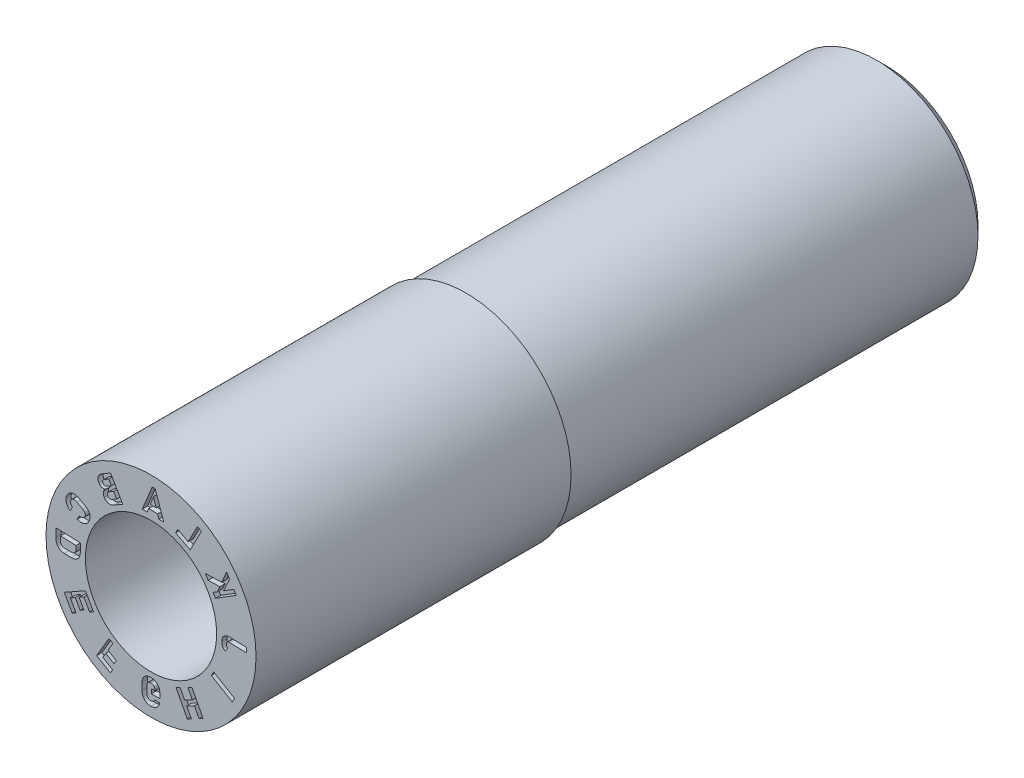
from build123d import *

# Parameters (mm, degrees)
SKETCH5_W          = 8
SKETCH5_H          = 1
CUT_EXTRUDE1_DEPTH = 0.1
CUT_EXTRUDE2_DEPTH = 1.4


with BuildPart() as part:
    # Sketch1 → Revolve1 (revolve)
    with BuildSketch(Plane(origin=(0, 0, 0), x_dir=(0, 0, -1), z_dir=(1, 0, 0)), mode=Mode.PRIVATE) as revolve1_sk:
        Polygon((0, 2), (0, 1.25), (2.3, 1.25), (2.3, 0.7), (11, 0.7), (11, 1), (14, 1), (14, 1.75), (13.75, 2), align=None)
    revolve(revolve1_sk.sketch.rotate(Axis((0, 0, 3.797909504), (0, 0, -1)), 90), axis=Axis((0, 0, 3.797909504), (0, 0, -1)))

    # Sketch5 → Cut-Revolve1 (revolve, cut)
    with BuildSketch(Plane(origin=(0, 0, 0), x_dir=(0, 0, -1), z_dir=(1, 0, 0)), mode=Mode.PRIVATE) as cut_revolve1_sk:
        with Locations((10, 2.435)):
            Rectangle(SKETCH5_W, SKETCH5_H)
    revolve(cut_revolve1_sk.sketch.rotate(Axis((0, 0, 0), (0, 0, -1)), 90), axis=Axis((0, 0, 0), (0, 0, -1)), mode=Mode.SUBTRACT)

    # Sketch2 → Cut-Extrude1 (cut)
    # profile 1 of 12: a face of its own
    with BuildSketch(Plane.XY):
        Polygon((1.381212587, 0.776958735), (1.496621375, 1.02720109), (1.438429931, 1.120801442), (1.348322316, 0.902255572), (1.03337183, 0.891912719), (1.088285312, 0.803622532), (1.310974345, 0.811672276), (1.267502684, 0.70623666), (1.181978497, 0.65304474), (1.228250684, 0.578619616), (1.622964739, 0.824112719), (1.576692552, 0.898537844), align=None)
    # profile 2 of 12: a face of its own
    with BuildSketch(Plane.XY):
        Polygon((0.960546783, 1.548117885), (0.882788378, 1.588596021), (0.706967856, 1.25096761), (0.508350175, 1.35436682), (0.469332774, 1.279470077), (0.74570217, 1.135551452), align=None)
    # profile 3 of 12: a face of its own
    with BuildSketch(Plane.XY):
        Polygon((0.079383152, 1.810573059), (0.023916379, 1.812203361), (-0.166871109, 1.353559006), (-0.072752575, 1.350873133), (-0.044591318, 1.424386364), (0.125311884, 1.41949923), (0.14921421, 1.344440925), (0.243238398, 1.341760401), align=None)
        Polygon((0.047336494, 1.664358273), (0.098229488, 1.504543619), (-0.012662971, 1.507733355), align=None, mode=Mode.SUBTRACT)
    # profile 4 of 12: a face of its own
    with BuildSketch(Plane.XY):
        Polygon((-1.369071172, -0.703640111), (-1.278697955, -0.652777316), (-1.169444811, -0.846851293), (-1.096124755, -0.805632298), (-1.248214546, -0.535511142), (-1.651541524, -0.762506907), (-1.499451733, -1.032628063), (-1.426261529, -0.99144066), (-1.535536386, -0.797328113), (-1.442331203, -0.744871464), (-1.350230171, -0.908506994), (-1.276990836, -0.867238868), align=None)
    # profile 5 of 12: a face of its own
    with BuildSketch(Plane.XY):
        Polygon((-0.818029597, -1.301353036), (-0.724539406, -1.142713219), (-0.799850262, -1.098358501), (-1.035402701, -1.498058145), (-0.772937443, -1.652731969), (-0.730123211, -1.580105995), (-0.917302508, -1.469805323), (-0.860767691, -1.373873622), (-0.703740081, -1.466359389), (-0.66096293, -1.393861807), align=None)
    # profile 6 of 12: a face of its own
    with BuildSketch(Plane.XY):
        with BuildLine():
            Line((-0.76999513, 1.645690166), (-0.932770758, 1.551211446))
            add(Edge.make_bspline(
                [(-0.932770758, 1.551211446), (-0.944851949, 1.544305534), (-0.96148658, 1.532651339), (-0.980382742, 1.514469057), (-0.991605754, 1.500427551), (-1.000489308, 1.485769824), (-1.006965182, 1.470551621), (-1.010795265, 1.454778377), (-1.012072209, 1.438596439), (-1.011042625, 1.422065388), (-1.005764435, 1.399168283), (-0.998456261, 1.382638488), (-0.992217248, 1.372063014)],
                knots=[0, 0, 0, 0, 0.19484118, 0.28294724, 0.366427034, 0.445852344, 0.52229235, 0.597128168, 0.672122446, 0.748836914, 0.828156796, 1, 1, 1, 1], degree=3))
            add(Edge.make_bspline(
                [(-0.992217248, 1.372063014), (-0.987840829, 1.364759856), (-0.980697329, 1.354303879), (-0.968655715, 1.34301533), (-0.959247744, 1.335893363), (-0.948994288, 1.330341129), (-0.938260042, 1.325964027), (-0.92684056, 1.323246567), (-0.914935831, 1.321933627), (-0.902588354, 1.321954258), (-0.885177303, 1.324089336), (-0.872225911, 1.327783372), (-0.863639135, 1.330975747)],
                knots=[0, 0, 0, 0, 0.17252886, 0.253082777, 0.332553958, 0.410187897, 0.487931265, 0.566064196, 0.646434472, 0.729377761, 0.814892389, 1, 1, 1, 1], degree=3))
            add(Edge.make_bspline(
                [(-0.863639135, 1.330975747), (-0.871279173, 1.324980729), (-0.881809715, 1.315279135), (-0.893113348, 1.300393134), (-0.899630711, 1.288880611), (-0.904784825, 1.277020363), (-0.908006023, 1.264757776), (-0.909711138, 1.252244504), (-0.909500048, 1.239480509), (-0.907719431, 1.226525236), (-0.902916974, 1.208715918), (-0.896854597, 1.195921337), (-0.89204892, 1.187636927)],
                knots=[0, 0, 0, 0, 0.180279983, 0.263920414, 0.345728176, 0.425166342, 0.503120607, 0.580165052, 0.658736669, 0.739148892, 0.82220143, 1, 1, 1, 1], degree=3))
            Line((-0.89204892, 1.187636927), (-0.891592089, 1.186722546))
            add(Edge.make_bspline(
                [(-0.891592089, 1.186722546), (-0.885361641, 1.1760686), (-0.874770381, 1.161196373), (-0.857155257, 1.145374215), (-0.843285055, 1.136099), (-0.828498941, 1.129101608), (-0.81277676, 1.124724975), (-0.796287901, 1.122628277), (-0.779050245, 1.123177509), (-0.76125995, 1.126034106), (-0.736064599, 1.133386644), (-0.717785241, 1.142269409), (-0.705755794, 1.149250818)],
                knots=[0, 0, 0, 0, 0.17235677, 0.251845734, 0.328866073, 0.40420085, 0.478853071, 0.555422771, 0.635018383, 0.718404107, 0.805968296, 1, 1, 1, 1], degree=3))
            Line((-0.705755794, 1.149250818), (-0.674117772, 1.167606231))
            Line((-0.674117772, 1.167606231), (-0.538255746, 1.246470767))
            Line((-0.538255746, 1.246470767), (-0.76999513, 1.645690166))
        make_face()
        with BuildLine():
            Line((-0.71124775, 1.371339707), (-0.655493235, 1.275290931))
            Line((-0.655493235, 1.275290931), (-0.740625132, 1.22590533))
            add(Edge.make_bspline(
                [(-0.740625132, 1.22590533), (-0.748329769, 1.221497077), (-0.760153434, 1.216076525), (-0.776587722, 1.213838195), (-0.787754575, 1.214804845), (-0.798213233, 1.218036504), (-0.811134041, 1.225988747), (-0.818474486, 1.235139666), (-0.822350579, 1.241941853)],
                knots=[0, 0, 0, 0, 0.283177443, 0.406051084, 0.522898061, 0.63653052, 0.750637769, 1, 1, 1, 1], degree=3))
            Line((-0.822350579, 1.241941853), (-0.82280741, 1.242856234))
            add(Edge.make_bspline(
                [(-0.82280741, 1.242856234), (-0.825469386, 1.247576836), (-0.828985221, 1.254801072), (-0.83117338, 1.264958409), (-0.83164284, 1.272238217), (-0.830945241, 1.279351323), (-0.82937095, 1.286337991), (-0.826300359, 1.292990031), (-0.822398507, 1.299498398), (-0.817383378, 1.305696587), (-0.809128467, 1.313814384), (-0.801634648, 1.318752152), (-0.796422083, 1.321929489)],
                knots=[0, 0, 0, 0, 0.172443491, 0.251642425, 0.328086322, 0.402714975, 0.477610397, 0.553923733, 0.633837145, 0.717731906, 0.805932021, 1, 1, 1, 1], degree=3))
            Line((-0.796422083, 1.321929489), (-0.71124775, 1.371339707))
        make_face(mode=Mode.SUBTRACT)
        with BuildLine():
            Line((-0.753380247, 1.443921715), (-0.8385011, 1.39454252))
            add(Edge.make_bspline(
                [(-0.8385011, 1.39454252), (-0.845445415, 1.390461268), (-0.856258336, 1.385719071), (-0.871216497, 1.383886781), (-0.881448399, 1.384935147), (-0.890980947, 1.388331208), (-0.903122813, 1.395782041), (-0.909647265, 1.404845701), (-0.913510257, 1.41109266)],
                knots=[0, 0, 0, 0, 0.277909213, 0.39883638, 0.514792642, 0.628277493, 0.744294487, 1, 1, 1, 1], degree=3))
            add(Edge.make_bspline(
                [(-0.913510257, 1.41109266), (-0.916820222, 1.416906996), (-0.920714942, 1.426324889), (-0.920561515, 1.43940649), (-0.918390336, 1.448683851), (-0.913872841, 1.457505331), (-0.90480302, 1.469312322), (-0.895010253, 1.475901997), (-0.888194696, 1.480109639)],
                knots=[0, 0, 0, 0, 0.243538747, 0.354355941, 0.466789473, 0.583916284, 0.708822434, 1, 1, 1, 1], degree=3))
            Line((-0.888194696, 1.480109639), (-0.803056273, 1.529499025))
            Line((-0.803056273, 1.529499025), (-0.753380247, 1.443921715))
        make_face(mode=Mode.SUBTRACT)
    # profile 7 of 12: a face of its own
    with BuildSketch(Plane.XY):
        Polygon((0.826795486, -1.394382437), (0.915050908, -1.563830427), (0.992334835, -1.523602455), (0.778913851, -1.113840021), (0.701629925, -1.154067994), (0.788091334, -1.320071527), (0.640968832, -1.396700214), (0.55450727, -1.230696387), (0.477354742, -1.270899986), (0.690775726, -1.68066242), (0.767928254, -1.64045882), (0.679672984, -1.471011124), align=None)
    # profile 8 of 12: a face of its own
    with BuildSketch(Plane.XY):
        with BuildLine():
            Line((-1.257346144, 0.865272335), (-1.369236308, 0.926025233))
            add(Edge.make_bspline(
                [(-1.369236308, 0.926025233), (-1.376996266, 0.93025275), (-1.388711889, 0.935946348), (-1.404572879, 0.942279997), (-1.416163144, 0.945971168), (-1.42754116, 0.949160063), (-1.438841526, 0.951426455), (-1.449996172, 0.952818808), (-1.460965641, 0.953536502), (-1.471744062, 0.953437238), (-1.482287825, 0.952526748), (-1.492614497, 0.950956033), (-1.502719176, 0.948619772), (-1.512517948, 0.945305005), (-1.522184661, 0.941516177), (-1.531502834, 0.936752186), (-1.540605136, 0.931292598), (-1.549452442, 0.925131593), (-1.557906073, 0.918106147), (-1.566125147, 0.910448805), (-1.573911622, 0.901953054), (-1.581401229, 0.892804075), (-1.591101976, 0.879433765), (-1.59765434, 0.86867861), (-1.601701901, 0.861172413)],
                knots=[0, 0, 0, 0, 0.096578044, 0.142249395, 0.186560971, 0.229482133, 0.271363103, 0.312409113, 0.352282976, 0.391447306, 0.430113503, 0.467872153, 0.50555694, 0.543307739, 0.58085384, 0.61895477, 0.657544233, 0.696821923, 0.736671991, 0.777602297, 0.819525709, 0.86253931, 0.906790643, 1, 1, 1, 1], degree=3))
            add(Edge.make_bspline(
                [(-1.601701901, 0.861172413), (-1.608322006, 0.848980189), (-1.616397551, 0.829904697), (-1.621537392, 0.803281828), (-1.622874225, 0.783603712), (-1.62155904, 0.763997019), (-1.617606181, 0.744621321), (-1.611003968, 0.725572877), (-1.60176879, 0.706933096), (-1.590019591, 0.688758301), (-1.57062437, 0.664663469), (-1.552950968, 0.648690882), (-1.5402667, 0.63865604)],
                knots=[0, 0, 0, 0, 0.164326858, 0.242585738, 0.319786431, 0.397014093, 0.474298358, 0.553007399, 0.63480756, 0.719758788, 0.808514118, 1, 1, 1, 1], degree=3))
            Line((-1.5402667, 0.63865604), (-1.497020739, 0.718336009))
            add(Edge.make_bspline(
                [(-1.497020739, 0.718336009), (-1.502657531, 0.723144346), (-1.510253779, 0.730926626), (-1.518920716, 0.74214654), (-1.523982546, 0.750685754), (-1.527980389, 0.7593218), (-1.531096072, 0.767939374), (-1.53285784, 0.776715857), (-1.53358919, 0.785464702), (-1.533323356, 0.794192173), (-1.53101056, 0.805813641), (-1.527864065, 0.814221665), (-1.524833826, 0.819480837)],
                knots=[0, 0, 0, 0, 0.194580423, 0.285088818, 0.372104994, 0.454905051, 0.535045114, 0.612398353, 0.689462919, 0.765515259, 0.841074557, 1, 1, 1, 1], degree=3))
            add(Edge.make_bspline(
                [(-1.524833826, 0.819480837), (-1.521202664, 0.826200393), (-1.514925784, 0.835513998), (-1.50458527, 0.845782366), (-1.496278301, 0.85171523), (-1.487409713, 0.856305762), (-1.477887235, 0.859190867), (-1.467903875, 0.860823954), (-1.457434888, 0.860866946), (-1.446554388, 0.859545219), (-1.431210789, 0.85533581), (-1.419869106, 0.850589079), (-1.412533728, 0.846424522)],
                knots=[0, 0, 0, 0, 0.174575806, 0.25460613, 0.33169913, 0.406966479, 0.48170551, 0.558069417, 0.637335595, 0.720086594, 0.807714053, 1, 1, 1, 1], degree=3))
            Line((-1.412533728, 0.846424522), (-1.300643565, 0.785671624))
            add(Edge.make_bspline(
                [(-1.300643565, 0.785671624), (-1.293202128, 0.781671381), (-1.282911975, 0.774900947), (-1.271138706, 0.764206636), (-1.264113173, 0.755881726), (-1.258601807, 0.747056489), (-1.25453323, 0.73787993), (-1.251994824, 0.728321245), (-1.250936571, 0.718447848), (-1.251363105, 0.708246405), (-1.254335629, 0.693956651), (-1.258634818, 0.683548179), (-1.262308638, 0.676824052)],
                knots=[0, 0, 0, 0, 0.193323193, 0.280391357, 0.363185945, 0.441772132, 0.517735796, 0.592050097, 0.66716421, 0.744174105, 0.824716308, 1, 1, 1, 1], degree=3))
            add(Edge.make_bspline(
                [(-1.262308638, 0.676824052), (-1.265236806, 0.671466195), (-1.270379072, 0.66391153), (-1.279099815, 0.655717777), (-1.286066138, 0.650416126), (-1.293823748, 0.646284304), (-1.302060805, 0.64289083), (-1.310950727, 0.640711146), (-1.320354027, 0.63949303), (-1.330266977, 0.639291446), (-1.34449062, 0.640449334), (-1.355188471, 0.643042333), (-1.362346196, 0.64522315)],
                knots=[0, 0, 0, 0, 0.160106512, 0.236416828, 0.312414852, 0.38847097, 0.465745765, 0.544991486, 0.627212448, 0.713454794, 0.803971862, 1, 1, 1, 1], degree=3))
            Line((-1.362346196, 0.64522315), (-1.405592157, 0.565543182))
            add(Edge.make_bspline(
                [(-1.405592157, 0.565543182), (-1.390234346, 0.560344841), (-1.367129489, 0.554483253), (-1.336331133, 0.551318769), (-1.314683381, 0.551424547), (-1.29403936, 0.553808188), (-1.274480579, 0.558604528), (-1.256105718, 0.565773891), (-1.238916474, 0.575191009), (-1.223161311, 0.586971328), (-1.20362285, 0.60572215), (-1.192129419, 0.622949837), (-1.185389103, 0.635053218)],
                knots=[0, 0, 0, 0, 0.191936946, 0.280786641, 0.365795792, 0.447660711, 0.526184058, 0.603468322, 0.680471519, 0.757424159, 0.835658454, 1, 1, 1, 1], degree=3))
            add(Edge.make_bspline(
                [(-1.185389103, 0.635053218), (-1.181418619, 0.642591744), (-1.175787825, 0.653879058), (-1.16996221, 0.669351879), (-1.166270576, 0.680600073), (-1.163515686, 0.691769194), (-1.161464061, 0.702794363), (-1.160351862, 0.713711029), (-1.159867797, 0.724482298), (-1.160208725, 0.735107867), (-1.161357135, 0.745524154), (-1.163179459, 0.755722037), (-1.165951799, 0.765641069), (-1.169274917, 0.775423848), (-1.173628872, 0.78490638), (-1.178501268, 0.794303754), (-1.184348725, 0.803352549), (-1.190826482, 0.8122204), (-1.198222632, 0.820638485), (-1.206121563, 0.828992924), (-1.215023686, 0.836774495), (-1.224482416, 0.844476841), (-1.238431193, 0.854330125), (-1.24960673, 0.861038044), (-1.257346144, 0.865272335)],
                knots=[0, 0, 0, 0, 0.093262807, 0.137640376, 0.180739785, 0.22266658, 0.263368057, 0.303292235, 0.342581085, 0.381222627, 0.41943327, 0.457118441, 0.494380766, 0.531982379, 0.569989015, 0.608385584, 0.647662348, 0.687699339, 0.728383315, 0.770139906, 0.813349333, 0.857582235, 0.903517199, 1, 1, 1, 1], degree=3))
        make_face()
    # profile 9 of 12: a face of its own
    with BuildSketch(Plane.XY):
        with BuildLine():
            Line((-1.805473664, 0.221110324), (-1.810357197, 0.067733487))
            add(Edge.make_bspline(
                [(-1.810357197, 0.067733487), (-1.810768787, 0.058379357), (-1.810426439, 0.044597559), (-1.8091359, 0.026582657), (-1.807367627, 0.013866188), (-1.805075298, 0.00161944), (-1.802030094, -0.010065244), (-1.798507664, -0.021298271), (-1.794305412, -0.03195861), (-1.789415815, -0.042040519), (-1.784126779, -0.051650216), (-1.778041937, -0.060540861), (-1.771444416, -0.068860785), (-1.764382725, -0.076665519), (-1.756666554, -0.083809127), (-1.748356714, -0.090347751), (-1.739413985, -0.09619119), (-1.730037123, -0.101593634), (-1.72004955, -0.106193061), (-1.709586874, -0.110199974), (-1.698632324, -0.113548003), (-1.68720422, -0.116280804), (-1.671044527, -0.11915859), (-1.658544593, -0.120052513), (-1.65007769, -0.120367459)],
                knots=[0, 0, 0, 0, 0.099840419, 0.147050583, 0.19267447, 0.236787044, 0.279949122, 0.321464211, 0.362367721, 0.402106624, 0.44099024, 0.479320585, 0.516927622, 0.554255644, 0.591533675, 0.629018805, 0.66696391, 0.705454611, 0.744410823, 0.784179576, 0.824950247, 0.866567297, 0.909520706, 1, 1, 1, 1], degree=3))
            Line((-1.65007769, -0.120367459), (-1.518627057, -0.124579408))
            add(Edge.make_bspline(
                [(-1.518627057, -0.124579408), (-1.510537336, -0.124763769), (-1.498548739, -0.124653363), (-1.482875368, -0.122966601), (-1.471670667, -0.121074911), (-1.460861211, -0.118416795), (-1.450379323, -0.115246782), (-1.440302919, -0.111340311), (-1.430576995, -0.106879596), (-1.421352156, -0.101659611), (-1.412504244, -0.095951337), (-1.4042809, -0.089384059), (-1.39650409, -0.082199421), (-1.389175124, -0.074383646), (-1.382444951, -0.065819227), (-1.376168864, -0.056683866), (-1.37040295, -0.046872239), (-1.365174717, -0.03647564), (-1.360679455, -0.025379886), (-1.356712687, -0.013754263), (-1.353329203, -0.001523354), (-1.350728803, 0.011315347), (-1.348043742, 0.029580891), (-1.346816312, 0.043642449), (-1.346618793, 0.053226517)],
                knots=[0, 0, 0, 0, 0.086517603, 0.127857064, 0.168353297, 0.207852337, 0.246738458, 0.285295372, 0.3232555, 0.360976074, 0.398475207, 0.43565571, 0.473275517, 0.511549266, 0.550019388, 0.5895643, 0.629909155, 0.671546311, 0.71380609, 0.757736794, 0.802760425, 0.849318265, 0.897623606, 1, 1, 1, 1], degree=3))
            Line((-1.346618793, 0.053226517), (-1.341753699, 0.206320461))
            Line((-1.341753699, 0.206320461), (-1.805473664, 0.221110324))
        make_face()
        with BuildLine():
            Line((-1.428757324, 0.121591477), (-1.430875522, 0.053604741))
            add(Edge.make_bspline(
                [(-1.430875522, 0.053604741), (-1.431130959, 0.046837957), (-1.431958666, 0.036931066), (-1.434681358, 0.024323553), (-1.436977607, 0.015659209), (-1.440384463, 0.007768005), (-1.444118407, 0.000392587), (-1.448541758, -0.006350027), (-1.453593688, -0.012423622), (-1.459275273, -0.017710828), (-1.465404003, -0.022421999), (-1.472074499, -0.026333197), (-1.47932567, -0.029404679), (-1.487046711, -0.031698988), (-1.498295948, -0.034006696), (-1.507121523, -0.034304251), (-1.513109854, -0.034123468)],
                knots=[0, 0, 0, 0, 0.148913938, 0.217405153, 0.283219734, 0.345356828, 0.405771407, 0.46464101, 0.522070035, 0.578853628, 0.634762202, 0.691562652, 0.748185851, 0.807298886, 0.868222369, 1, 1, 1, 1], degree=3))
            Line((-1.513109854, -0.034123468), (-1.649664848, -0.029768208))
            add(Edge.make_bspline(
                [(-1.649664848, -0.029768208), (-1.655640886, -0.02946593), (-1.664451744, -0.028725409), (-1.6755542, -0.025788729), (-1.683136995, -0.022897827), (-1.690153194, -0.019349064), (-1.696648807, -0.015096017), (-1.702475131, -0.010017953), (-1.707798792, -0.004307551), (-1.712380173, 0.002123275), (-1.716450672, 0.00903504), (-1.719718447, 0.016621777), (-1.722432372, 0.024769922), (-1.724392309, 0.03353266), (-1.726117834, 0.046314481), (-1.726452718, 0.056230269), (-1.726194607, 0.063005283)],
                knots=[0, 0, 0, 0, 0.131618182, 0.192911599, 0.251525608, 0.309450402, 0.365196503, 0.421480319, 0.478703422, 0.536159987, 0.594459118, 0.654455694, 0.717114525, 0.782747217, 0.851228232, 1, 1, 1, 1], degree=3))
            Line((-1.726194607, 0.063005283), (-1.724075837, 0.131010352))
            Line((-1.724075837, 0.131010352), (-1.428757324, 0.121591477))
        make_face(mode=Mode.SUBTRACT)
    # profile 10 of 12: a face of its own
    with BuildSketch(Plane.XY):
        with BuildLine():
            Line((0.168186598, -1.606851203), (0.1680387, -1.516227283))
            add(Edge.make_bspline(
                [(0.1680387, -1.516227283), (0.16806695, -1.507857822), (0.167314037, -1.495501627), (0.165270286, -1.479296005), (0.16288332, -1.467731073), (0.160045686, -1.456482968), (0.156321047, -1.445716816), (0.152120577, -1.435266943), (0.147244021, -1.425229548), (0.141679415, -1.415718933), (0.135667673, -1.406664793), (0.12901724, -1.398216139), (0.121909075, -1.390265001), (0.11417726, -1.382935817), (0.106021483, -1.376065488), (0.097163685, -1.369956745), (0.087945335, -1.364180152), (0.078146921, -1.359232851), (0.067987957, -1.354787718), (0.057430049, -1.35113316), (0.046509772, -1.347998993), (0.035180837, -1.345807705), (0.019420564, -1.343352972), (0.007301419, -1.342916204), (-0.000861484, -1.342867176)],
                knots=[0, 0, 0, 0, 0.092004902, 0.136060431, 0.179552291, 0.221827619, 0.263577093, 0.304759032, 0.345670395, 0.386201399, 0.425892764, 0.465127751, 0.504379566, 0.543104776, 0.582235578, 0.621551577, 0.661368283, 0.701814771, 0.742172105, 0.783266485, 0.824628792, 0.867033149, 0.910107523, 1, 1, 1, 1], degree=3))
            add(Edge.make_bspline(
                [(-0.000861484, -1.342867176), (-0.009053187, -1.342994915), (-0.021241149, -1.343330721), (-0.037066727, -1.34573525), (-0.048474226, -1.3477589), (-0.059457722, -1.35076162), (-0.070137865, -1.354153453), (-0.080404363, -1.358319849), (-0.090241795, -1.363137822), (-0.099655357, -1.368436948), (-0.108538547, -1.374328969), (-0.116848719, -1.380728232), (-0.124680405, -1.387610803), (-0.131849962, -1.395120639), (-0.138656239, -1.402993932), (-0.144672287, -1.411571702), (-0.150318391, -1.420492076), (-0.155242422, -1.429942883), (-0.159475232, -1.439782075), (-0.163286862, -1.449916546), (-0.16616848, -1.460491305), (-0.168503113, -1.471429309), (-0.170671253, -1.486694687), (-0.171298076, -1.498403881), (-0.171278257, -1.506293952)],
                knots=[0, 0, 0, 0, 0.09254373, 0.137065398, 0.180480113, 0.223143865, 0.265392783, 0.306830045, 0.347987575, 0.388886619, 0.428601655, 0.468117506, 0.507126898, 0.546077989, 0.585158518, 0.624398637, 0.664134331, 0.704183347, 0.744447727, 0.784913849, 0.826206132, 0.86794848, 0.911012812, 1, 1, 1, 1], degree=3))
            Line((-0.171278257, -1.506293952), (-0.171153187, -1.643127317))
            add(Edge.make_bspline(
                [(-0.171153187, -1.643127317), (-0.171141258, -1.651489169), (-0.170524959, -1.66390433), (-0.168235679, -1.680069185), (-0.166064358, -1.691686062), (-0.162991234, -1.702830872), (-0.159496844, -1.713682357), (-0.155113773, -1.72406652), (-0.150250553, -1.734096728), (-0.144839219, -1.743652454), (-0.138739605, -1.752597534), (-0.132169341, -1.761045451), (-0.124987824, -1.768900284), (-0.117296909, -1.776235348), (-0.109131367, -1.78309429), (-0.100266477, -1.789242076), (-0.090996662, -1.794931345), (-0.081242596, -1.799954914), (-0.071119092, -1.804398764), (-0.060524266, -1.807912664), (-0.049654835, -1.81106593), (-0.038359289, -1.813272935), (-0.022628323, -1.815714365), (-0.010509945, -1.816156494), (-0.002346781, -1.816203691)],
                knots=[0, 0, 0, 0, 0.092106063, 0.136600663, 0.179731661, 0.222142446, 0.263826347, 0.305185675, 0.346141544, 0.386542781, 0.425990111, 0.465267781, 0.504305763, 0.543073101, 0.582246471, 0.621605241, 0.661761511, 0.701943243, 0.74234448, 0.783370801, 0.824778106, 0.866888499, 0.910009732, 1, 1, 1, 1], degree=3))
            add(Edge.make_bspline(
                [(-0.002346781, -1.816203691), (0.011036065, -1.81615091), (0.030970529, -1.814231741), (0.056400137, -1.806984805), (0.074313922, -1.799467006), (0.091173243, -1.790078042), (0.106524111, -1.778666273), (0.120636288, -1.765674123), (0.133073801, -1.750886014), (0.143856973, -1.73459369), (0.155758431, -1.71081195), (0.161696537, -1.691529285), (0.164319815, -1.678281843)],
                knots=[0, 0, 0, 0, 0.170685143, 0.253412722, 0.336186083, 0.417811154, 0.498756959, 0.579437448, 0.661793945, 0.744424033, 0.827919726, 1, 1, 1, 1], degree=3))
            Line((0.164319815, -1.678281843), (0.069916, -1.678420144))
            add(Edge.make_bspline(
                [(0.069916, -1.678420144), (0.068346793, -1.683190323), (0.065273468, -1.690100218), (0.059438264, -1.698292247), (0.054379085, -1.70392976), (0.048550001, -1.70885037), (0.042383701, -1.713377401), (0.035627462, -1.717121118), (0.028450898, -1.720190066), (0.020991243, -1.722655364), (0.010720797, -1.724861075), (0.002859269, -1.725580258), (-0.002400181, -1.725580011)],
                knots=[0, 0, 0, 0, 0.163363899, 0.243451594, 0.326083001, 0.40880313, 0.490912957, 0.57433318, 0.659148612, 0.744284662, 0.829223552, 1, 1, 1, 1], degree=3))
            add(Edge.make_bspline(
                [(-0.002400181, -1.725580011), (-0.009765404, -1.725628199), (-0.020612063, -1.724477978), (-0.034213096, -1.720153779), (-0.043475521, -1.715698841), (-0.051885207, -1.709993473), (-0.059330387, -1.703204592), (-0.065693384, -1.695322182), (-0.071056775, -1.686470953), (-0.075420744, -1.676740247), (-0.079422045, -1.662271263), (-0.080655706, -1.650858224), (-0.080624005, -1.643073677)],
                knots=[0, 0, 0, 0, 0.172666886, 0.253210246, 0.33344179, 0.412675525, 0.490535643, 0.568703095, 0.649222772, 0.732493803, 0.817769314, 1, 1, 1, 1], degree=3))
            Line((-0.080624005, -1.643073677), (-0.080749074, -1.506240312))
            add(Edge.make_bspline(
                [(-0.080749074, -1.506240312), (-0.080728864, -1.499390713), (-0.079735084, -1.489204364), (-0.075428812, -1.476528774), (-0.071014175, -1.46792955), (-0.065628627, -1.460005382), (-0.059035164, -1.453109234), (-0.051398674, -1.447166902), (-0.042814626, -1.442242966), (-0.03339118, -1.43825783), (-0.01943212, -1.43443224), (-0.008349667, -1.43346898), (-0.000808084, -1.433490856)],
                knots=[0, 0, 0, 0, 0.169109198, 0.249373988, 0.328520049, 0.406674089, 0.484642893, 0.562592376, 0.644333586, 0.727806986, 0.814063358, 1, 1, 1, 1], degree=3))
            add(Edge.make_bspline(
                [(-0.000808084, -1.433490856), (0.006615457, -1.43346511), (0.017562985, -1.43456042), (0.031309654, -1.438698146), (0.040602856, -1.443006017), (0.049044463, -1.448369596), (0.056418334, -1.45498653), (0.062901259, -1.462564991), (0.068149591, -1.471361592), (0.072279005, -1.481076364), (0.07641671, -1.495575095), (0.07734036, -1.507171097), (0.077418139, -1.515052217)],
                knots=[0, 0, 0, 0, 0.174269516, 0.256124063, 0.335844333, 0.413975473, 0.489918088, 0.567536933, 0.64715774, 0.729278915, 0.814678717, 1, 1, 1, 1], degree=3))
            Line((0.077418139, -1.515052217), (0.077398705, -1.522706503))
            Line((0.077398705, -1.522706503), (0.00728095, -1.522811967))
            Line((0.00728095, -1.522811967), (0.007445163, -1.607010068))
            Line((0.007445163, -1.607010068), (0.168186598, -1.606851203))
        make_face()
    # profile 11 of 12: a face of its own
    with BuildSketch(Plane.XY):
        Polygon((1.194305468, -0.655470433), (1.148125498, -0.733392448), (1.54721355, -0.969979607), (1.593393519, -0.892057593), align=None)
    # profile 12 of 12: a face of its own
    with BuildSketch(Plane.XY):
        with BuildLine():
            Line((1.408214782, -0.201308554), (1.462137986, -0.131214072))
            add(Edge.make_bspline(
                [(1.462137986, -0.131214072), (1.457429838, -0.127435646), (1.451104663, -0.120921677), (1.44427767, -0.111025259), (1.440075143, -0.103139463), (1.436859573, -0.094913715), (1.433719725, -0.08368179), (1.433093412, -0.074935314), (1.433187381, -0.069145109)],
                knots=[0, 0, 0, 0, 0.255157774, 0.381525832, 0.507703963, 0.632352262, 0.754582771, 1, 1, 1, 1], degree=3))
            add(Edge.make_bspline(
                [(1.433187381, -0.069145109), (1.433204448, -0.061502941), (1.435721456, -0.050343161), (1.44368771, -0.03773277), (1.451869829, -0.030239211), (1.462041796, -0.024563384), (1.478783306, -0.018917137), (1.492731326, -0.018177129), (1.502321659, -0.018437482)],
                knots=[0, 0, 0, 0, 0.235744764, 0.344345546, 0.456618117, 0.574941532, 0.702083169, 1, 1, 1, 1], degree=3))
            Line((1.502321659, -0.018437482), (1.818327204, -0.027030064))
            Line((1.818327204, -0.027030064), (1.820755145, 0.063502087))
            Line((1.820755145, 0.063502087), (1.504372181, 0.072115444))
            add(Edge.make_bspline(
                [(1.504372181, 0.072115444), (1.48941204, 0.072588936), (1.467512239, 0.07127375), (1.439923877, 0.064651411), (1.4245142, 0.058645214), (1.413191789, 0.052736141), (1.40524765, 0.047891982), (1.397788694, 0.042488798), (1.390881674, 0.036538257), (1.384419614, 0.030155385), (1.37850896, 0.023223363), (1.373131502, 0.015763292), (1.368112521, 0.00788599), (1.363647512, -0.000490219), (1.35991209, -0.009411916), (1.35652272, -0.018686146), (1.353727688, -0.028431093), (1.351438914, -0.038603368), (1.349326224, -0.053047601), (1.348340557, -0.064120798), (1.348156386, -0.071657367)],
                knots=[0, 0, 0, 0, 0.186082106, 0.270784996, 0.351714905, 0.39085543, 0.429404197, 0.467248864, 0.50518049, 0.542599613, 0.580024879, 0.618246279, 0.656801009, 0.696035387, 0.736035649, 0.776905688, 0.818687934, 0.861935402, 0.906379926, 1, 1, 1, 1], degree=3))
            add(Edge.make_bspline(
                [(1.348156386, -0.071657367), (1.34770586, -0.085211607), (1.349180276, -0.105235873), (1.355432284, -0.130726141), (1.362265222, -0.148204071), (1.371017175, -0.164211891), (1.384998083, -0.183357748), (1.398511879, -0.194878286), (1.408214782, -0.201308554)],
                knots=[0, 0, 0, 0, 0.272168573, 0.40060543, 0.525709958, 0.64786343, 0.76601662, 1, 1, 1, 1], degree=3))
        make_face()
    extrude(amount=-CUT_EXTRUDE1_DEPTH, mode=Mode.SUBTRACT)

    # Sketch3 → Cut-Extrude2 (cut)
    with BuildSketch(Plane.XY.offset(-2.3)):
        Polygon((0.404145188, 0.7), (-0.404145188, 0.7), (-0.808290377, 0), (-0.404145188, -0.7), (0.404145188, -0.7), (0.808290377, 0), align=None)
    extrude(amount=-CUT_EXTRUDE2_DEPTH, mode=Mode.SUBTRACT)


solid = part.part
